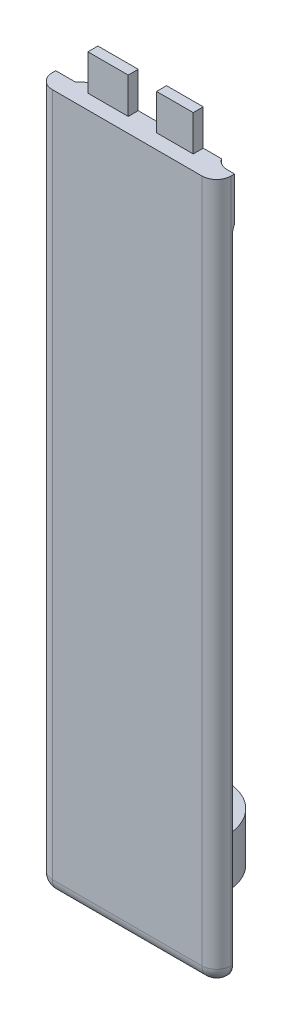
ISO-10303-21;
HEADER;
FILE_DESCRIPTION(('STEP AP214'),'2;1');
FILE_NAME('part.step','',(''),(''),'','','');
FILE_SCHEMA(('AUTOMOTIVE_DESIGN { 1 0 10303 214 1 1 1 1 }'));
ENDSEC;
DATA;
#1=APPLICATION_CONTEXT('core data for automotive mechanical design processes');
#2=APPLICATION_PROTOCOL_DEFINITION('international standard','automotive_design',2000,#1);
#3=PRODUCT_CONTEXT('',#1,'mechanical');
#4=PRODUCT('Part','Part','',(#3));
#5=PRODUCT_RELATED_PRODUCT_CATEGORY('part','',(#4));
#6=PRODUCT_DEFINITION_FORMATION('','',#4);
#7=PRODUCT_DEFINITION_CONTEXT('part definition',#1,'design');
#8=PRODUCT_DEFINITION('design','',#6,#7);
#9=PRODUCT_DEFINITION_SHAPE('','',#8);
#10=(LENGTH_UNIT() NAMED_UNIT(*) SI_UNIT(.MILLI.,.METRE.));
#11=(NAMED_UNIT(*) PLANE_ANGLE_UNIT() SI_UNIT($,.RADIAN.));
#12=(NAMED_UNIT(*) SI_UNIT($,.STERADIAN.) SOLID_ANGLE_UNIT());
#13=UNCERTAINTY_MEASURE_WITH_UNIT(LENGTH_MEASURE(1.E-05),#10,'distance_accuracy_value','');
#14=(GEOMETRIC_REPRESENTATION_CONTEXT(3) GLOBAL_UNCERTAINTY_ASSIGNED_CONTEXT((#13)) GLOBAL_UNIT_ASSIGNED_CONTEXT((#10,
#11,#12)) REPRESENTATION_CONTEXT('',''));
#15=CARTESIAN_POINT('',(0.,0.,0.));
#16=DIRECTION('',(0.,0.,1.));
#17=DIRECTION('',(1.,0.,0.));
#18=AXIS2_PLACEMENT_3D('',#15,#16,#17);
#19=CARTESIAN_POINT('',(18.3794784,75.486715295,5.07999999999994));
#20=DIRECTION('',(-1.,0.,0.));
#21=DIRECTION('',(0.,-1.,0.));
#22=AXIS2_PLACEMENT_3D('',#19,#20,#21);
#23=PLANE('',#22);
#24=DIRECTION('',(0.,1.,0.));
#25=VECTOR('',#24,1.);
#26=CARTESIAN_POINT('',(18.3794784,-75.486715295,2.07999999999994));
#27=LINE('',#26,#25);
#28=CARTESIAN_POINT('',(18.3794784,68.1207152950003,2.07999999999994));
#29=VERTEX_POINT('',#28);
#30=CARTESIAN_POINT('',(18.3794784,-72.486715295,2.07999999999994));
#31=VERTEX_POINT('',#30);
#32=EDGE_CURVE('E337',#29,#31,#27,.F.);
#33=ORIENTED_EDGE('',*,*,#32,.T.);
#34=DIRECTION('',(0.,0.,-1.));
#35=VECTOR('',#34,1.);
#36=CARTESIAN_POINT('',(18.3794784,-72.486715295,5.07999999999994));
#37=LINE('',#36,#35);
#38=CARTESIAN_POINT('',(18.3794784,-72.486715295,1.78588006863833));
#39=VERTEX_POINT('',#38);
#40=EDGE_CURVE('E356',#31,#39,#37,.T.);
#41=ORIENTED_EDGE('',*,*,#40,.T.);
#42=DIRECTION('',(0.,-1.,0.));
#43=VECTOR('',#42,1.);
#44=CARTESIAN_POINT('',(18.3794784,60.403284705,1.78588006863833));
#45=LINE('',#44,#43);
#46=CARTESIAN_POINT('',(18.3794784,57.6599449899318,1.78588006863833));
#47=VERTEX_POINT('',#46);
#48=EDGE_CURVE('E316',#47,#39,#45,.T.);
#49=ORIENTED_EDGE('',*,*,#48,.F.);
#50=CARTESIAN_POINT('',(18.3794784,57.6599449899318,-1.21411993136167));
#51=DIRECTION('',(-1.,0.,0.));
#52=DIRECTION('',(0.,-1.,0.));
#53=AXIS2_PLACEMENT_3D('',#50,#51,#52);
#54=CIRCLE('',#53,3.);
#55=CARTESIAN_POINT('',(18.3794784,59.1939911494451,1.364));
#56=VERTEX_POINT('',#55);
#57=EDGE_CURVE('E423',#47,#56,#54,.T.);
#58=ORIENTED_EDGE('',*,*,#57,.T.);
#59=DIRECTION('',(0.,-1.,0.));
#60=VECTOR('',#59,1.);
#61=CARTESIAN_POINT('',(18.3794784,68.1207152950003,1.364));
#62=LINE('',#61,#60);
#63=CARTESIAN_POINT('',(18.3794784,68.1207152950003,1.364));
#64=VERTEX_POINT('',#63);
#65=EDGE_CURVE('E238',#64,#56,#62,.T.);
#66=ORIENTED_EDGE('',*,*,#65,.F.);
#67=DIRECTION('',(0.,0.,-1.));
#68=VECTOR('',#67,1.);
#69=CARTESIAN_POINT('',(18.3794784,68.1207152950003,5.07999999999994));
#70=LINE('',#69,#68);
#71=EDGE_CURVE('E298',#29,#64,#70,.T.);
#72=ORIENTED_EDGE('',*,*,#71,.F.);
#73=EDGE_LOOP('',(#33,#41,#49,#58,#66,#72));
#74=FACE_BOUND('',#73,.T.);
#75=ADVANCED_FACE('F34',(#74),#23,.F.);
#76=CARTESIAN_POINT('',(-18.3794784,75.486715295,5.07999999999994));
#77=DIRECTION('',(0.,-1.,0.));
#78=DIRECTION('',(0.,0.,-1.));
#79=AXIS2_PLACEMENT_3D('',#76,#77,#78);
#80=PLANE('',#79);
#81=DIRECTION('',(0.,0.,-1.));
#82=VECTOR('',#81,1.);
#83=CARTESIAN_POINT('',(-2.79308503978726,75.486715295,0.));
#84=LINE('',#83,#82);
#85=CARTESIAN_POINT('',(-2.79308503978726,75.486715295,2.05831786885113));
#86=VERTEX_POINT('',#85);
#87=CARTESIAN_POINT('',(-2.79308503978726,75.486715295,0.));
#88=VERTEX_POINT('',#87);
#89=EDGE_CURVE('E249',#86,#88,#84,.T.);
#90=ORIENTED_EDGE('',*,*,#89,.T.);
#91=DIRECTION('',(-1.,0.,0.));
#92=VECTOR('',#91,1.);
#93=CARTESIAN_POINT('',(-18.3794784,75.486715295,0.));
#94=LINE('',#93,#92);
#95=CARTESIAN_POINT('',(-11.0789714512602,75.486715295,0.));
#96=VERTEX_POINT('',#95);
#97=EDGE_CURVE('E321',#88,#96,#94,.T.);
#98=ORIENTED_EDGE('',*,*,#97,.T.);
#99=DIRECTION('',(0.,0.,-1.));
#100=VECTOR('',#99,1.);
#101=CARTESIAN_POINT('',(-11.0789714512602,75.486715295,0.));
#102=LINE('',#101,#100);
#103=CARTESIAN_POINT('',(-11.0789714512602,75.486715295,2.05831786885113));
#104=VERTEX_POINT('',#103);
#105=EDGE_CURVE('E267',#104,#96,#102,.T.);
#106=ORIENTED_EDGE('',*,*,#105,.F.);
#107=DIRECTION('',(-1.,0.,0.));
#108=VECTOR('',#107,1.);
#109=CARTESIAN_POINT('',(18.3794784,75.486715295,2.05831786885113));
#110=LINE('',#109,#108);
#111=EDGE_CURVE('E296',#86,#104,#110,.T.);
#112=ORIENTED_EDGE('',*,*,#111,.F.);
#113=EDGE_LOOP('',(#90,#98,#106,#112));
#114=FACE_BOUND('',#113,.T.);
#115=ADVANCED_FACE('F457',(#114),#80,.F.);
#116=CARTESIAN_POINT('',(0.,0.,0.));
#117=DIRECTION('',(0.,0.,1.));
#118=DIRECTION('',(1.,0.,0.));
#119=AXIS2_PLACEMENT_3D('',#116,#117,#118);
#120=PLANE('',#119);
#121=DIRECTION('',(1.,0.,0.));
#122=VECTOR('',#121,1.);
#123=CARTESIAN_POINT('',(-18.3794784,60.403284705,0.));
#124=LINE('',#123,#122);
#125=CARTESIAN_POINT('',(-11.8087661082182,60.403284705,0.));
#126=VERTEX_POINT('',#125);
#127=CARTESIAN_POINT('',(14.3383237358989,60.403284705,0.));
#128=VERTEX_POINT('',#127);
#129=EDGE_CURVE('E314',#126,#128,#124,.T.);
#130=ORIENTED_EDGE('',*,*,#129,.F.);
#131=DIRECTION('',(0.,-1.,0.));
#132=VECTOR('',#131,1.);
#133=CARTESIAN_POINT('',(-11.8087661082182,0.,0.));
#134=LINE('',#133,#132);
#135=CARTESIAN_POINT('',(-11.8087661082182,68.1207152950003,0.));
#136=VERTEX_POINT('',#135);
#137=EDGE_CURVE('E43',#126,#136,#134,.F.);
#138=ORIENTED_EDGE('',*,*,#137,.T.);
#139=DIRECTION('',(-1.,0.,0.));
#140=VECTOR('',#139,1.);
#141=CARTESIAN_POINT('',(-18.3794784,68.1207152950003,0.));
#142=LINE('',#141,#140);
#143=CARTESIAN_POINT('',(-11.0789714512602,68.1207152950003,0.));
#144=VERTEX_POINT('',#143);
#145=EDGE_CURVE('E225',#144,#136,#142,.T.);
#146=ORIENTED_EDGE('',*,*,#145,.F.);
#147=DIRECTION('',(0.,1.,0.));
#148=VECTOR('',#147,1.);
#149=CARTESIAN_POINT('',(-11.0789714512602,68.1207152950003,0.));
#150=LINE('',#149,#148);
#151=EDGE_CURVE('E281',#144,#96,#150,.T.);
#152=ORIENTED_EDGE('',*,*,#151,.T.);
#153=ORIENTED_EDGE('',*,*,#97,.F.);
#154=DIRECTION('',(0.,1.,0.));
#155=VECTOR('',#154,1.);
#156=CARTESIAN_POINT('',(-2.79308503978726,68.1207152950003,0.));
#157=LINE('',#156,#155);
#158=CARTESIAN_POINT('',(-2.79308503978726,68.1207152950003,0.));
#159=VERTEX_POINT('',#158);
#160=EDGE_CURVE('E265',#159,#88,#157,.T.);
#161=ORIENTED_EDGE('',*,*,#160,.F.);
#162=DIRECTION('',(-1.,0.,0.));
#163=VECTOR('',#162,1.);
#164=CARTESIAN_POINT('',(0.,68.1207152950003,0.));
#165=LINE('',#164,#163);
#166=CARTESIAN_POINT('',(3.02839066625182,68.1207152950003,0.));
#167=VERTEX_POINT('',#166);
#168=EDGE_CURVE('E258',#167,#159,#165,.T.);
#169=ORIENTED_EDGE('',*,*,#168,.F.);
#170=DIRECTION('',(0.,1.,0.));
#171=VECTOR('',#170,1.);
#172=CARTESIAN_POINT('',(3.02839066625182,68.1207152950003,0.));
#173=LINE('',#172,#171);
#174=CARTESIAN_POINT('',(3.02839066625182,75.486715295,0.));
#175=VERTEX_POINT('',#174);
#176=EDGE_CURVE('E268',#167,#175,#173,.T.);
#177=ORIENTED_EDGE('',*,*,#176,.T.);
#178=CARTESIAN_POINT('',(10.5705623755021,75.486715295,0.));
#179=VERTEX_POINT('',#178);
#180=EDGE_CURVE('E323',#179,#175,#94,.T.);
#181=ORIENTED_EDGE('',*,*,#180,.F.);
#182=DIRECTION('',(0.,1.,0.));
#183=VECTOR('',#182,1.);
#184=CARTESIAN_POINT('',(10.5705623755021,68.1207152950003,0.));
#185=LINE('',#184,#183);
#186=CARTESIAN_POINT('',(10.5705623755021,68.1207152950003,0.));
#187=VERTEX_POINT('',#186);
#188=EDGE_CURVE('E291',#187,#179,#185,.T.);
#189=ORIENTED_EDGE('',*,*,#188,.F.);
#190=DIRECTION('',(-1.,0.,0.));
#191=VECTOR('',#190,1.);
#192=CARTESIAN_POINT('',(18.3794784,68.1207152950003,0.));
#193=LINE('',#192,#191);
#194=CARTESIAN_POINT('',(14.3383237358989,68.1207152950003,0.));
#195=VERTEX_POINT('',#194);
#196=EDGE_CURVE('E287',#195,#187,#193,.T.);
#197=ORIENTED_EDGE('',*,*,#196,.F.);
#198=DIRECTION('',(0.,1.,0.));
#199=VECTOR('',#198,1.);
#200=CARTESIAN_POINT('',(14.3383237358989,68.1207152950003,0.));
#201=LINE('',#200,#199);
#202=EDGE_CURVE('E235',#128,#195,#201,.T.);
#203=ORIENTED_EDGE('',*,*,#202,.F.);
#204=EDGE_LOOP('',(#130,#138,#146,#152,#153,#161,#169,#177,#181,#189,#197,#203));
#205=FACE_BOUND('',#204,.T.);
#206=ADVANCED_FACE('F463',(#205),#120,.F.);
#207=CARTESIAN_POINT('',(18.3794784,68.1207152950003,2.05831786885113));
#208=DIRECTION('',(0.,0.,-1.));
#209=DIRECTION('',(-1.,0.,0.));
#210=AXIS2_PLACEMENT_3D('',#207,#208,#209);
#211=PLANE('',#210);
#212=DIRECTION('',(0.,1.,0.));
#213=VECTOR('',#212,1.);
#214=CARTESIAN_POINT('',(-2.79308503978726,68.1207152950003,2.05831786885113));
#215=LINE('',#214,#213);
#216=CARTESIAN_POINT('',(-2.79308503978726,68.1207152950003,2.05831786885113));
#217=VERTEX_POINT('',#216);
#218=EDGE_CURVE('E261',#217,#86,#215,.T.);
#219=ORIENTED_EDGE('',*,*,#218,.T.);
#220=ORIENTED_EDGE('',*,*,#111,.T.);
#221=DIRECTION('',(0.,1.,0.));
#222=VECTOR('',#221,1.);
#223=CARTESIAN_POINT('',(-11.0789714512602,68.1207152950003,2.05831786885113));
#224=LINE('',#223,#222);
#225=CARTESIAN_POINT('',(-11.0789714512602,68.1207152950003,2.05831786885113));
#226=VERTEX_POINT('',#225);
#227=EDGE_CURVE('E278',#226,#104,#224,.T.);
#228=ORIENTED_EDGE('',*,*,#227,.F.);
#229=DIRECTION('',(-1.,0.,0.));
#230=VECTOR('',#229,1.);
#231=CARTESIAN_POINT('',(18.3794784,68.1207152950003,2.05831786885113));
#232=LINE('',#231,#230);
#233=EDGE_CURVE('E301',#217,#226,#232,.T.);
#234=ORIENTED_EDGE('',*,*,#233,.F.);
#235=EDGE_LOOP('',(#219,#220,#228,#234));
#236=FACE_BOUND('',#235,.T.);
#237=ADVANCED_FACE('F567',(#236),#211,.F.);
#238=CARTESIAN_POINT('',(-18.3794784,75.486715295,5.07999999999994));
#239=DIRECTION('',(1.,0.,0.));
#240=DIRECTION('',(0.,1.,0.));
#241=AXIS2_PLACEMENT_3D('',#238,#239,#240);
#242=PLANE('',#241);
#243=DIRECTION('',(0.,1.,0.));
#244=VECTOR('',#243,1.);
#245=CARTESIAN_POINT('',(-18.3794784,68.1207152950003,1.364));
#246=LINE('',#245,#244);
#247=CARTESIAN_POINT('',(-18.3794784,59.1939911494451,1.364));
#248=VERTEX_POINT('',#247);
#249=CARTESIAN_POINT('',(-18.3794784,68.1207152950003,1.364));
#250=VERTEX_POINT('',#249);
#251=EDGE_CURVE('E233',#248,#250,#246,.T.);
#252=ORIENTED_EDGE('',*,*,#251,.F.);
#253=CARTESIAN_POINT('',(-18.3794784,57.6599449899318,-1.21411993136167));
#254=DIRECTION('',(1.,0.,0.));
#255=DIRECTION('',(0.,1.,0.));
#256=AXIS2_PLACEMENT_3D('',#253,#254,#255);
#257=CIRCLE('',#256,3.);
#258=CARTESIAN_POINT('',(-18.3794784,57.6599449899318,1.78588006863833));
#259=VERTEX_POINT('',#258);
#260=EDGE_CURVE('E421',#248,#259,#257,.T.);
#261=ORIENTED_EDGE('',*,*,#260,.T.);
#262=DIRECTION('',(0.,-1.,0.));
#263=VECTOR('',#262,1.);
#264=CARTESIAN_POINT('',(-18.3794784,60.403284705,1.78588006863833));
#265=LINE('',#264,#263);
#266=CARTESIAN_POINT('',(-18.3794784,-72.486715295,1.78588006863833));
#267=VERTEX_POINT('',#266);
#268=EDGE_CURVE('E319',#259,#267,#265,.T.);
#269=ORIENTED_EDGE('',*,*,#268,.T.);
#270=DIRECTION('',(0.,0.,-1.));
#271=VECTOR('',#270,1.);
#272=CARTESIAN_POINT('',(-18.3794784,-72.486715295,5.07999999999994));
#273=LINE('',#272,#271);
#274=CARTESIAN_POINT('',(-18.3794784,-72.486715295,2.07999999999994));
#275=VERTEX_POINT('',#274);
#276=EDGE_CURVE('E352',#267,#275,#273,.F.);
#277=ORIENTED_EDGE('',*,*,#276,.T.);
#278=DIRECTION('',(0.,-1.,0.));
#279=VECTOR('',#278,1.);
#280=CARTESIAN_POINT('',(-18.3794784,68.1207152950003,2.07999999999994));
#281=LINE('',#280,#279);
#282=CARTESIAN_POINT('',(-18.3794784,68.1207152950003,2.07999999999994));
#283=VERTEX_POINT('',#282);
#284=EDGE_CURVE('E329',#275,#283,#281,.F.);
#285=ORIENTED_EDGE('',*,*,#284,.T.);
#286=DIRECTION('',(0.,0.,1.));
#287=VECTOR('',#286,1.);
#288=CARTESIAN_POINT('',(-18.3794784,68.1207152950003,5.07999999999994));
#289=LINE('',#288,#287);
#290=EDGE_CURVE('E306',#250,#283,#289,.T.);
#291=ORIENTED_EDGE('',*,*,#290,.F.);
#292=EDGE_LOOP('',(#252,#261,#269,#277,#285,#291));
#293=FACE_BOUND('',#292,.T.);
#294=ADVANCED_FACE('F574',(#293),#242,.F.);
#295=CARTESIAN_POINT('',(0.,0.,5.07999999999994));
#296=DIRECTION('',(0.,0.,1.));
#297=DIRECTION('',(1.,0.,0.));
#298=AXIS2_PLACEMENT_3D('',#295,#296,#297);
#299=PLANE('',#298);
#300=DIRECTION('',(0.,-1.,0.));
#301=VECTOR('',#300,1.);
#302=CARTESIAN_POINT('',(-15.3794784,-75.486715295,5.07999999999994));
#303=LINE('',#302,#301);
#304=CARTESIAN_POINT('',(-15.3794784,68.1207152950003,5.07999999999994));
#305=VERTEX_POINT('',#304);
#306=CARTESIAN_POINT('',(-15.3794784,-72.486715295,5.07999999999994));
#307=VERTEX_POINT('',#306);
#308=EDGE_CURVE('E326',#305,#307,#303,.T.);
#309=ORIENTED_EDGE('',*,*,#308,.T.);
#310=DIRECTION('',(1.,0.,0.));
#311=VECTOR('',#310,1.);
#312=CARTESIAN_POINT('',(15.3794784,-72.486715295,5.07999999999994));
#313=LINE('',#312,#311);
#314=CARTESIAN_POINT('',(15.3794784,-72.486715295,5.07999999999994));
#315=VERTEX_POINT('',#314);
#316=EDGE_CURVE('E361',#307,#315,#313,.T.);
#317=ORIENTED_EDGE('',*,*,#316,.T.);
#318=DIRECTION('',(0.,1.,0.));
#319=VECTOR('',#318,1.);
#320=CARTESIAN_POINT('',(15.3794784,68.1207152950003,5.07999999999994));
#321=LINE('',#320,#319);
#322=CARTESIAN_POINT('',(15.3794784,68.1207152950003,5.07999999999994));
#323=VERTEX_POINT('',#322);
#324=EDGE_CURVE('E333',#315,#323,#321,.T.);
#325=ORIENTED_EDGE('',*,*,#324,.T.);
#326=DIRECTION('',(1.,0.,0.));
#327=VECTOR('',#326,1.);
#328=CARTESIAN_POINT('',(18.3794784,68.1207152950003,5.07999999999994));
#329=LINE('',#328,#327);
#330=EDGE_CURVE('E308',#305,#323,#329,.T.);
#331=ORIENTED_EDGE('',*,*,#330,.F.);
#332=EDGE_LOOP('',(#309,#317,#325,#331));
#333=FACE_BOUND('',#332,.T.);
#334=ADVANCED_FACE('F571',(#333),#299,.T.);
#335=ORIENTED_EDGE('',*,*,#180,.T.);
#336=DIRECTION('',(0.,0.,-1.));
#337=VECTOR('',#336,1.);
#338=CARTESIAN_POINT('',(3.02839066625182,75.486715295,0.));
#339=LINE('',#338,#337);
#340=CARTESIAN_POINT('',(3.02839066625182,75.486715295,2.05831786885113));
#341=VERTEX_POINT('',#340);
#342=EDGE_CURVE('E255',#341,#175,#339,.T.);
#343=ORIENTED_EDGE('',*,*,#342,.F.);
#344=CARTESIAN_POINT('',(10.5705623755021,75.486715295,2.05831786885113));
#345=VERTEX_POINT('',#344);
#346=EDGE_CURVE('E302',#345,#341,#110,.T.);
#347=ORIENTED_EDGE('',*,*,#346,.F.);
#348=DIRECTION('',(0.,0.,1.));
#349=VECTOR('',#348,1.);
#350=CARTESIAN_POINT('',(10.5705623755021,75.486715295,2.05831786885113));
#351=LINE('',#350,#349);
#352=EDGE_CURVE('E284',#179,#345,#351,.T.);
#353=ORIENTED_EDGE('',*,*,#352,.F.);
#354=EDGE_LOOP('',(#335,#343,#347,#353));
#355=FACE_BOUND('',#354,.T.);
#356=ADVANCED_FACE('F466',(#355),#80,.F.);
#357=CARTESIAN_POINT('',(-18.3794784,-75.486715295,5.07999999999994));
#358=DIRECTION('',(0.,1.,0.));
#359=DIRECTION('',(0.,0.,1.));
#360=AXIS2_PLACEMENT_3D('',#357,#358,#359);
#361=PLANE('',#360);
#362=DIRECTION('',(1.,0.,0.));
#363=VECTOR('',#362,1.);
#364=CARTESIAN_POINT('',(-15.3794784,-75.486715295,2.07999999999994));
#365=LINE('',#364,#363);
#366=CARTESIAN_POINT('',(15.3794784,-75.486715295,2.07999999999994));
#367=VERTEX_POINT('',#366);
#368=CARTESIAN_POINT('',(-15.3794784,-75.486715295,2.07999999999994));
#369=VERTEX_POINT('',#368);
#370=EDGE_CURVE('E340',#367,#369,#365,.F.);
#371=ORIENTED_EDGE('',*,*,#370,.T.);
#372=DIRECTION('',(0.,0.,-1.));
#373=VECTOR('',#372,1.);
#374=CARTESIAN_POINT('',(-15.3794784,-75.486715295,5.07999999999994));
#375=LINE('',#374,#373);
#376=CARTESIAN_POINT('',(-15.3794784,-75.486715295,1.78588006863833));
#377=VERTEX_POINT('',#376);
#378=EDGE_CURVE('E344',#369,#377,#375,.T.);
#379=ORIENTED_EDGE('',*,*,#378,.T.);
#380=DIRECTION('',(-1.,0.,0.));
#381=VECTOR('',#380,1.);
#382=CARTESIAN_POINT('',(-18.3794784,-75.486715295,1.78588006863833));
#383=LINE('',#382,#381);
#384=CARTESIAN_POINT('',(15.3794784,-75.486715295,1.78588006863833));
#385=VERTEX_POINT('',#384);
#386=EDGE_CURVE('E311',#385,#377,#383,.T.);
#387=ORIENTED_EDGE('',*,*,#386,.F.);
#388=DIRECTION('',(0.,0.,-1.));
#389=VECTOR('',#388,1.);
#390=CARTESIAN_POINT('',(15.3794784,-75.486715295,5.07999999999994));
#391=LINE('',#390,#389);
#392=EDGE_CURVE('E342',#385,#367,#391,.F.);
#393=ORIENTED_EDGE('',*,*,#392,.T.);
#394=EDGE_LOOP('',(#371,#379,#387,#393));
#395=FACE_BOUND('',#394,.T.);
#396=ADVANCED_FACE('F570',(#395),#361,.F.);
#397=CARTESIAN_POINT('',(-18.3794784,60.403284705,1.78588006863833));
#398=DIRECTION('',(0.,0.,1.));
#399=DIRECTION('',(1.,0.,0.));
#400=AXIS2_PLACEMENT_3D('',#397,#398,#399);
#401=PLANE('',#400);
#402=DIRECTION('',(1.,0.,0.));
#403=VECTOR('',#402,1.);
#404=CARTESIAN_POINT('',(-18.3794784,-70.836715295,1.78588006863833));
#405=LINE('',#404,#403);
#406=CARTESIAN_POINT('',(-12.0851937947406,-70.836715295,1.78588006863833));
#407=VERTEX_POINT('',#406);
#408=CARTESIAN_POINT('',(11.4851937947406,-70.836715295,1.78588006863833));
#409=VERTEX_POINT('',#408);
#410=EDGE_CURVE('E363',#407,#409,#405,.T.);
#411=ORIENTED_EDGE('',*,*,#410,.T.);
#412=DIRECTION('',(0.,-1.,0.));
#413=VECTOR('',#412,1.);
#414=CARTESIAN_POINT('',(11.4851937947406,-54.836715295,1.78588006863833));
#415=LINE('',#414,#413);
#416=CARTESIAN_POINT('',(11.4851937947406,-54.836715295,1.78588006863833));
#417=VERTEX_POINT('',#416);
#418=EDGE_CURVE('E392',#409,#417,#415,.F.);
#419=ORIENTED_EDGE('',*,*,#418,.T.);
#420=DIRECTION('',(1.,0.,0.));
#421=VECTOR('',#420,1.);
#422=CARTESIAN_POINT('',(-6.17499041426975,-54.836715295,1.78588006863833));
#423=LINE('',#422,#421);
#424=CARTESIAN_POINT('',(-12.0851937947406,-54.836715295,1.78588006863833));
#425=VERTEX_POINT('',#424);
#426=EDGE_CURVE('E381',#417,#425,#423,.F.);
#427=ORIENTED_EDGE('',*,*,#426,.T.);
#428=DIRECTION('',(0.,-1.,0.));
#429=VECTOR('',#428,1.);
#430=CARTESIAN_POINT('',(-12.0851937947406,-70.836715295,1.78588006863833));
#431=LINE('',#430,#429);
#432=EDGE_CURVE('E389',#425,#407,#431,.T.);
#433=ORIENTED_EDGE('',*,*,#432,.T.);
#434=EDGE_LOOP('',(#411,#419,#427,#433));
#435=FACE_BOUND('',#434,.T.);
#436=ORIENTED_EDGE('',*,*,#268,.F.);
#437=DIRECTION('',(1.,0.,0.));
#438=VECTOR('',#437,1.);
#439=CARTESIAN_POINT('',(-18.3794784,57.6599449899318,1.78588006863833));
#440=LINE('',#439,#438);
#441=EDGE_CURVE('E417',#259,#47,#440,.T.);
#442=ORIENTED_EDGE('',*,*,#441,.T.);
#443=ORIENTED_EDGE('',*,*,#48,.T.);
#444=CARTESIAN_POINT('',(15.3794784,-72.486715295,1.78588006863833));
#445=DIRECTION('',(0.,0.,1.));
#446=DIRECTION('',(1.,0.,0.));
#447=AXIS2_PLACEMENT_3D('',#444,#445,#446);
#448=CIRCLE('',#447,3.);
#449=EDGE_CURVE('E347',#39,#385,#448,.F.);
#450=ORIENTED_EDGE('',*,*,#449,.T.);
#451=ORIENTED_EDGE('',*,*,#386,.T.);
#452=CARTESIAN_POINT('',(-15.3794784,-72.486715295,1.78588006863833));
#453=DIRECTION('',(0.,0.,1.));
#454=DIRECTION('',(1.,0.,0.));
#455=AXIS2_PLACEMENT_3D('',#452,#453,#454);
#456=CIRCLE('',#455,3.);
#457=EDGE_CURVE('E349',#377,#267,#456,.F.);
#458=ORIENTED_EDGE('',*,*,#457,.T.);
#459=EDGE_LOOP('',(#436,#442,#443,#450,#451,#458));
#460=FACE_BOUND('',#459,.T.);
#461=ADVANCED_FACE('F520',(#435,#460),#401,.F.);
#462=ORIENTED_EDGE('',*,*,#346,.T.);
#463=DIRECTION('',(0.,1.,0.));
#464=VECTOR('',#463,1.);
#465=CARTESIAN_POINT('',(3.02839066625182,68.1207152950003,2.05831786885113));
#466=LINE('',#465,#464);
#467=CARTESIAN_POINT('',(3.02839066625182,68.1207152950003,2.05831786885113));
#468=VERTEX_POINT('',#467);
#469=EDGE_CURVE('E271',#468,#341,#466,.T.);
#470=ORIENTED_EDGE('',*,*,#469,.F.);
#471=CARTESIAN_POINT('',(10.5705623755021,68.1207152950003,2.05831786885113));
#472=VERTEX_POINT('',#471);
#473=EDGE_CURVE('E303',#472,#468,#232,.T.);
#474=ORIENTED_EDGE('',*,*,#473,.F.);
#475=DIRECTION('',(0.,1.,0.));
#476=VECTOR('',#475,1.);
#477=CARTESIAN_POINT('',(10.5705623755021,68.1207152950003,2.05831786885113));
#478=LINE('',#477,#476);
#479=EDGE_CURVE('E293',#472,#345,#478,.T.);
#480=ORIENTED_EDGE('',*,*,#479,.T.);
#481=EDGE_LOOP('',(#462,#470,#474,#480));
#482=FACE_BOUND('',#481,.T.);
#483=ADVANCED_FACE('F563',(#482),#211,.F.);
#484=CARTESIAN_POINT('',(0.,68.1207152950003,0.));
#485=DIRECTION('',(0.,1.,0.));
#486=DIRECTION('',(0.,0.,1.));
#487=AXIS2_PLACEMENT_3D('',#484,#485,#486);
#488=PLANE('',#487);
#489=ORIENTED_EDGE('',*,*,#145,.T.);
#490=CARTESIAN_POINT('',(-11.8087661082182,68.1207152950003,3.));
#491=DIRECTION('',(0.,1.,0.));
#492=DIRECTION('',(0.,0.,1.));
#493=AXIS2_PLACEMENT_3D('',#490,#491,#492);
#494=CIRCLE('',#493,3.);
#495=CARTESIAN_POINT('',(-14.3234239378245,68.1207152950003,1.364));
#496=VERTEX_POINT('',#495);
#497=EDGE_CURVE('E11',#136,#496,#494,.T.);
#498=ORIENTED_EDGE('',*,*,#497,.T.);
#499=DIRECTION('',(1.,0.,0.));
#500=VECTOR('',#499,1.);
#501=CARTESIAN_POINT('',(-18.3794784,68.1207152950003,1.364));
#502=LINE('',#501,#500);
#503=EDGE_CURVE('E222',#250,#496,#502,.T.);
#504=ORIENTED_EDGE('',*,*,#503,.F.);
#505=ORIENTED_EDGE('',*,*,#290,.T.);
#506=CARTESIAN_POINT('',(-15.3794784,68.1207152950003,2.07999999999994));
#507=DIRECTION('',(0.,1.,0.));
#508=DIRECTION('',(0.,0.,1.));
#509=AXIS2_PLACEMENT_3D('',#506,#507,#508);
#510=CIRCLE('',#509,3.);
#511=EDGE_CURVE('E331',#283,#305,#510,.T.);
#512=ORIENTED_EDGE('',*,*,#511,.T.);
#513=ORIENTED_EDGE('',*,*,#330,.T.);
#514=CARTESIAN_POINT('',(15.3794784,68.1207152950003,2.07999999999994));
#515=DIRECTION('',(0.,1.,0.));
#516=DIRECTION('',(0.,0.,1.));
#517=AXIS2_PLACEMENT_3D('',#514,#515,#516);
#518=CIRCLE('',#517,3.);
#519=EDGE_CURVE('E335',#323,#29,#518,.T.);
#520=ORIENTED_EDGE('',*,*,#519,.T.);
#521=ORIENTED_EDGE('',*,*,#71,.T.);
#522=DIRECTION('',(1.,0.,0.));
#523=VECTOR('',#522,1.);
#524=CARTESIAN_POINT('',(18.3794784,68.1207152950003,1.364));
#525=LINE('',#524,#523);
#526=CARTESIAN_POINT('',(16.8529815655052,68.1207152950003,1.364));
#527=VERTEX_POINT('',#526);
#528=EDGE_CURVE('E243',#527,#64,#525,.T.);
#529=ORIENTED_EDGE('',*,*,#528,.F.);
#530=CARTESIAN_POINT('',(16.8529815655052,68.1207152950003,-1.636));
#531=DIRECTION('',(0.,1.,0.));
#532=DIRECTION('',(0.,0.,1.));
#533=AXIS2_PLACEMENT_3D('',#530,#531,#532);
#534=CIRCLE('',#533,3.);
#535=EDGE_CURVE('E432',#527,#195,#534,.F.);
#536=ORIENTED_EDGE('',*,*,#535,.T.);
#537=ORIENTED_EDGE('',*,*,#196,.T.);
#538=DIRECTION('',(0.,0.,1.));
#539=VECTOR('',#538,1.);
#540=CARTESIAN_POINT('',(10.5705623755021,68.1207152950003,2.05831786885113));
#541=LINE('',#540,#539);
#542=EDGE_CURVE('E289',#187,#472,#541,.T.);
#543=ORIENTED_EDGE('',*,*,#542,.T.);
#544=ORIENTED_EDGE('',*,*,#473,.T.);
#545=DIRECTION('',(0.,0.,-1.));
#546=VECTOR('',#545,1.);
#547=CARTESIAN_POINT('',(3.02839066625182,68.1207152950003,0.));
#548=LINE('',#547,#546);
#549=EDGE_CURVE('E254',#468,#167,#548,.T.);
#550=ORIENTED_EDGE('',*,*,#549,.T.);
#551=ORIENTED_EDGE('',*,*,#168,.T.);
#552=DIRECTION('',(0.,0.,-1.));
#553=VECTOR('',#552,1.);
#554=CARTESIAN_POINT('',(-2.79308503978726,68.1207152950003,0.));
#555=LINE('',#554,#553);
#556=EDGE_CURVE('E252',#217,#159,#555,.T.);
#557=ORIENTED_EDGE('',*,*,#556,.F.);
#558=ORIENTED_EDGE('',*,*,#233,.T.);
#559=DIRECTION('',(0.,0.,-1.));
#560=VECTOR('',#559,1.);
#561=CARTESIAN_POINT('',(-11.0789714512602,68.1207152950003,0.));
#562=LINE('',#561,#560);
#563=EDGE_CURVE('E275',#226,#144,#562,.T.);
#564=ORIENTED_EDGE('',*,*,#563,.T.);
#565=EDGE_LOOP('',(#489,#498,#504,#505,#512,#513,#520,#521,#529,#536,#537,#543,#544,#550,#551,
#557,#558,#564));
#566=FACE_BOUND('',#565,.T.);
#567=ADVANCED_FACE('F220',(#566),#488,.T.);
#568=CARTESIAN_POINT('',(10.5705623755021,68.1207152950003,2.05831786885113));
#569=DIRECTION('',(-1.,0.,0.));
#570=DIRECTION('',(0.,0.,1.));
#571=AXIS2_PLACEMENT_3D('',#568,#569,#570);
#572=PLANE('',#571);
#573=ORIENTED_EDGE('',*,*,#352,.T.);
#574=ORIENTED_EDGE('',*,*,#479,.F.);
#575=ORIENTED_EDGE('',*,*,#542,.F.);
#576=ORIENTED_EDGE('',*,*,#188,.T.);
#577=EDGE_LOOP('',(#573,#574,#575,#576));
#578=FACE_BOUND('',#577,.T.);
#579=ADVANCED_FACE('F556',(#578),#572,.F.);
#580=CARTESIAN_POINT('',(-11.0789714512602,68.1207152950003,0.));
#581=DIRECTION('',(1.,0.,0.));
#582=DIRECTION('',(0.,0.,-1.));
#583=AXIS2_PLACEMENT_3D('',#580,#581,#582);
#584=PLANE('',#583);
#585=ORIENTED_EDGE('',*,*,#105,.T.);
#586=ORIENTED_EDGE('',*,*,#151,.F.);
#587=ORIENTED_EDGE('',*,*,#563,.F.);
#588=ORIENTED_EDGE('',*,*,#227,.T.);
#589=EDGE_LOOP('',(#585,#586,#587,#588));
#590=FACE_BOUND('',#589,.T.);
#591=ADVANCED_FACE('F552',(#590),#584,.F.);
#592=CARTESIAN_POINT('',(-2.79308503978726,68.1207152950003,0.));
#593=DIRECTION('',(1.,0.,0.));
#594=DIRECTION('',(0.,0.,-1.));
#595=AXIS2_PLACEMENT_3D('',#592,#593,#594);
#596=PLANE('',#595);
#597=ORIENTED_EDGE('',*,*,#89,.F.);
#598=ORIENTED_EDGE('',*,*,#218,.F.);
#599=ORIENTED_EDGE('',*,*,#556,.T.);
#600=ORIENTED_EDGE('',*,*,#160,.T.);
#601=EDGE_LOOP('',(#597,#598,#599,#600));
#602=FACE_BOUND('',#601,.T.);
#603=ADVANCED_FACE('F548',(#602),#596,.T.);
#604=CARTESIAN_POINT('',(3.02839066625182,68.1207152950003,0.));
#605=DIRECTION('',(1.,0.,0.));
#606=DIRECTION('',(0.,0.,-1.));
#607=AXIS2_PLACEMENT_3D('',#604,#605,#606);
#608=PLANE('',#607);
#609=ORIENTED_EDGE('',*,*,#342,.T.);
#610=ORIENTED_EDGE('',*,*,#176,.F.);
#611=ORIENTED_EDGE('',*,*,#549,.F.);
#612=ORIENTED_EDGE('',*,*,#469,.T.);
#613=EDGE_LOOP('',(#609,#610,#611,#612));
#614=FACE_BOUND('',#613,.T.);
#615=ADVANCED_FACE('F541',(#614),#608,.F.);
#616=CARTESIAN_POINT('',(-0.3,-67.836715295,-5.92000000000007));
#617=DIRECTION('',(0.,1.,0.));
#618=DIRECTION('',(0.,0.,1.));
#619=AXIS2_PLACEMENT_3D('',#616,#617,#618);
#620=CYLINDRICAL_SURFACE('',#619,9.69);
#621=CARTESIAN_POINT('',(-0.3,-57.836715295,-5.92000000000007));
#622=DIRECTION('',(0.,-1.,0.));
#623=DIRECTION('',(0.,0.,-1.));
#624=AXIS2_PLACEMENT_3D('',#621,#622,#623);
#625=CIRCLE('',#624,9.69);
#626=CARTESIAN_POINT('',(-9.29909597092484,-57.836715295,-2.32662112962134));
#627=VERTEX_POINT('',#626);
#628=CARTESIAN_POINT('',(8.69909597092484,-57.836715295,-2.32662112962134));
#629=VERTEX_POINT('',#628);
#630=EDGE_CURVE('E244',#627,#629,#625,.T.);
#631=ORIENTED_EDGE('',*,*,#630,.T.);
#632=DIRECTION('',(0.,1.,0.));
#633=VECTOR('',#632,1.);
#634=CARTESIAN_POINT('',(8.69909597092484,-67.836715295,-2.32662112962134));
#635=LINE('',#634,#633);
#636=CARTESIAN_POINT('',(8.69909597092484,-67.836715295,-2.32662112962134));
#637=VERTEX_POINT('',#636);
#638=EDGE_CURVE('E386',#629,#637,#635,.F.);
#639=ORIENTED_EDGE('',*,*,#638,.T.);
#640=CARTESIAN_POINT('',(-0.3,-67.836715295,-5.92000000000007));
#641=DIRECTION('',(0.,-1.,0.));
#642=DIRECTION('',(0.,0.,-1.));
#643=AXIS2_PLACEMENT_3D('',#640,#641,#642);
#644=CIRCLE('',#643,9.69);
#645=CARTESIAN_POINT('',(-9.29909597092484,-67.836715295,-2.32662112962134));
#646=VERTEX_POINT('',#645);
#647=EDGE_CURVE('E246',#646,#637,#644,.T.);
#648=ORIENTED_EDGE('',*,*,#647,.F.);
#649=DIRECTION('',(0.,1.,0.));
#650=VECTOR('',#649,1.);
#651=CARTESIAN_POINT('',(-9.29909597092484,-67.836715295,-2.32662112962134));
#652=LINE('',#651,#650);
#653=EDGE_CURVE('E383',#646,#627,#652,.T.);
#654=ORIENTED_EDGE('',*,*,#653,.T.);
#655=EDGE_LOOP('',(#631,#639,#648,#654));
#656=FACE_BOUND('',#655,.T.);
#657=ADVANCED_FACE('F527',(#656),#620,.T.);
#658=CARTESIAN_POINT('',(-0.3,-67.836715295,-5.92000000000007));
#659=DIRECTION('',(0.,-1.,0.));
#660=DIRECTION('',(0.,0.,-1.));
#661=AXIS2_PLACEMENT_3D('',#658,#659,#660);
#662=PLANE('',#661);
#663=DIRECTION('',(1.,0.,0.));
#664=VECTOR('',#663,1.);
#665=CARTESIAN_POINT('',(-0.300000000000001,-67.836715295,-1.21411993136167));
#666=LINE('',#665,#664);
#667=CARTESIAN_POINT('',(8.48519379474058,-67.836715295,-1.21411993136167));
#668=VERTEX_POINT('',#667);
#669=CARTESIAN_POINT('',(-9.08519379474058,-67.836715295,-1.21411993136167));
#670=VERTEX_POINT('',#669);
#671=EDGE_CURVE('E377',#668,#670,#666,.F.);
#672=ORIENTED_EDGE('',*,*,#671,.T.);
#673=CARTESIAN_POINT('',(-12.0851937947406,-67.836715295,-1.21411993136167));
#674=DIRECTION('',(0.,-1.,0.));
#675=DIRECTION('',(0.,0.,-1.));
#676=AXIS2_PLACEMENT_3D('',#673,#674,#675);
#677=CIRCLE('',#676,3.);
#678=EDGE_CURVE('E415',#670,#646,#677,.F.);
#679=ORIENTED_EDGE('',*,*,#678,.T.);
#680=ORIENTED_EDGE('',*,*,#647,.T.);
#681=CARTESIAN_POINT('',(11.4851937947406,-67.836715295,-1.21411993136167));
#682=DIRECTION('',(0.,-1.,0.));
#683=DIRECTION('',(0.,0.,-1.));
#684=AXIS2_PLACEMENT_3D('',#681,#682,#683);
#685=CIRCLE('',#684,3.);
#686=EDGE_CURVE('E395',#637,#668,#685,.F.);
#687=ORIENTED_EDGE('',*,*,#686,.T.);
#688=EDGE_LOOP('',(#672,#679,#680,#687));
#689=FACE_BOUND('',#688,.T.);
#690=ADVANCED_FACE('F532',(#689),#662,.T.);
#691=CARTESIAN_POINT('',(-0.3,-57.836715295,-5.92000000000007));
#692=DIRECTION('',(0.,-1.,0.));
#693=DIRECTION('',(0.,0.,-1.));
#694=AXIS2_PLACEMENT_3D('',#691,#692,#693);
#695=PLANE('',#694);
#696=ORIENTED_EDGE('',*,*,#630,.F.);
#697=CARTESIAN_POINT('',(-12.0851937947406,-57.836715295,-1.21411993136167));
#698=DIRECTION('',(0.,-1.,0.));
#699=DIRECTION('',(0.,0.,-1.));
#700=AXIS2_PLACEMENT_3D('',#697,#698,#699);
#701=CIRCLE('',#700,3.);
#702=CARTESIAN_POINT('',(-9.08519379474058,-57.836715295,-1.21411993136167));
#703=VERTEX_POINT('',#702);
#704=EDGE_CURVE('E406',#627,#703,#701,.T.);
#705=ORIENTED_EDGE('',*,*,#704,.T.);
#706=DIRECTION('',(1.,0.,0.));
#707=VECTOR('',#706,1.);
#708=CARTESIAN_POINT('',(5.57499041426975,-57.836715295,-1.21411993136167));
#709=LINE('',#708,#707);
#710=CARTESIAN_POINT('',(8.48519379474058,-57.836715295,-1.21411993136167));
#711=VERTEX_POINT('',#710);
#712=EDGE_CURVE('E379',#703,#711,#709,.T.);
#713=ORIENTED_EDGE('',*,*,#712,.T.);
#714=CARTESIAN_POINT('',(11.4851937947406,-57.836715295,-1.21411993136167));
#715=DIRECTION('',(0.,-1.,0.));
#716=DIRECTION('',(0.,0.,-1.));
#717=AXIS2_PLACEMENT_3D('',#714,#715,#716);
#718=CIRCLE('',#717,3.);
#719=EDGE_CURVE('E404',#711,#629,#718,.T.);
#720=ORIENTED_EDGE('',*,*,#719,.T.);
#721=EDGE_LOOP('',(#696,#705,#713,#720));
#722=FACE_BOUND('',#721,.T.);
#723=ADVANCED_FACE('F529',(#722),#695,.F.);
#724=CARTESIAN_POINT('',(0.,0.,1.364));
#725=DIRECTION('',(0.,0.,-1.));
#726=DIRECTION('',(-1.,0.,0.));
#727=AXIS2_PLACEMENT_3D('',#724,#725,#726);
#728=PLANE('',#727);
#729=DIRECTION('',(1.,0.,0.));
#730=VECTOR('',#729,1.);
#731=CARTESIAN_POINT('',(18.3794784,59.1939911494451,1.364));
#732=LINE('',#731,#730);
#733=CARTESIAN_POINT('',(16.8529815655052,59.1939911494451,1.364));
#734=VERTEX_POINT('',#733);
#735=EDGE_CURVE('E426',#56,#734,#732,.F.);
#736=ORIENTED_EDGE('',*,*,#735,.T.);
#737=DIRECTION('',(0.,-1.,0.));
#738=VECTOR('',#737,1.);
#739=CARTESIAN_POINT('',(16.8529815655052,68.1207152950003,1.364));
#740=LINE('',#739,#738);
#741=EDGE_CURVE('E429',#734,#527,#740,.F.);
#742=ORIENTED_EDGE('',*,*,#741,.T.);
#743=ORIENTED_EDGE('',*,*,#528,.T.);
#744=ORIENTED_EDGE('',*,*,#65,.T.);
#745=EDGE_LOOP('',(#736,#742,#743,#744));
#746=FACE_BOUND('',#745,.T.);
#747=ADVANCED_FACE('F539',(#746),#728,.T.);
#748=CARTESIAN_POINT('',(0.,0.,1.364));
#749=DIRECTION('',(0.,0.,1.));
#750=DIRECTION('',(1.,0.,0.));
#751=AXIS2_PLACEMENT_3D('',#748,#749,#750);
#752=PLANE('',#751);
#753=ORIENTED_EDGE('',*,*,#251,.T.);
#754=ORIENTED_EDGE('',*,*,#503,.T.);
#755=DIRECTION('',(0.,-1.,0.));
#756=VECTOR('',#755,1.);
#757=CARTESIAN_POINT('',(-14.3234239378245,68.1207152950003,1.364));
#758=LINE('',#757,#756);
#759=CARTESIAN_POINT('',(-14.3234239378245,59.1939911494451,1.364));
#760=VERTEX_POINT('',#759);
#761=EDGE_CURVE('E232',#496,#760,#758,.T.);
#762=ORIENTED_EDGE('',*,*,#761,.T.);
#763=DIRECTION('',(1.,0.,0.));
#764=VECTOR('',#763,1.);
#765=CARTESIAN_POINT('',(-14.3234239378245,59.1939911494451,1.364));
#766=LINE('',#765,#764);
#767=EDGE_CURVE('E419',#760,#248,#766,.F.);
#768=ORIENTED_EDGE('',*,*,#767,.T.);
#769=EDGE_LOOP('',(#753,#754,#762,#768));
#770=FACE_BOUND('',#769,.T.);
#771=ADVANCED_FACE('F230',(#770),#752,.F.);
#772=CARTESIAN_POINT('',(-15.3794784,0.,2.07999999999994));
#773=DIRECTION('',(0.,1.,0.));
#774=DIRECTION('',(-1.,0.,0.));
#775=AXIS2_PLACEMENT_3D('',#772,#773,#774);
#776=CYLINDRICAL_SURFACE('',#775,3.);
#777=ORIENTED_EDGE('',*,*,#284,.F.);
#778=CARTESIAN_POINT('',(-15.3794784,-72.486715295,2.07999999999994));
#779=DIRECTION('',(0.,1.,0.));
#780=DIRECTION('',(-1.,0.,0.));
#781=AXIS2_PLACEMENT_3D('',#778,#779,#780);
#782=CIRCLE('',#781,3.);
#783=EDGE_CURVE('E354',#275,#307,#782,.T.);
#784=ORIENTED_EDGE('',*,*,#783,.T.);
#785=ORIENTED_EDGE('',*,*,#308,.F.);
#786=ORIENTED_EDGE('',*,*,#511,.F.);
#787=EDGE_LOOP('',(#777,#784,#785,#786));
#788=FACE_BOUND('',#787,.T.);
#789=ADVANCED_FACE('F469',(#788),#776,.T.);
#790=CARTESIAN_POINT('',(15.3794784,0.,2.07999999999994));
#791=DIRECTION('',(0.,-1.,0.));
#792=DIRECTION('',(1.,0.,0.));
#793=AXIS2_PLACEMENT_3D('',#790,#791,#792);
#794=CYLINDRICAL_SURFACE('',#793,3.);
#795=ORIENTED_EDGE('',*,*,#324,.F.);
#796=CARTESIAN_POINT('',(15.3794784,-72.486715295,2.07999999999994));
#797=DIRECTION('',(0.,-1.,0.));
#798=DIRECTION('',(1.,0.,0.));
#799=AXIS2_PLACEMENT_3D('',#796,#797,#798);
#800=CIRCLE('',#799,3.);
#801=EDGE_CURVE('E359',#315,#31,#800,.F.);
#802=ORIENTED_EDGE('',*,*,#801,.T.);
#803=ORIENTED_EDGE('',*,*,#32,.F.);
#804=ORIENTED_EDGE('',*,*,#519,.F.);
#805=EDGE_LOOP('',(#795,#802,#803,#804));
#806=FACE_BOUND('',#805,.T.);
#807=ADVANCED_FACE('F472',(#806),#794,.T.);
#808=CARTESIAN_POINT('',(15.3794784,-72.486715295,5.07999999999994));
#809=DIRECTION('',(0.,0.,-1.));
#810=DIRECTION('',(-1.,0.,0.));
#811=AXIS2_PLACEMENT_3D('',#808,#809,#810);
#812=CYLINDRICAL_SURFACE('',#811,3.);
#813=ORIENTED_EDGE('',*,*,#449,.F.);
#814=ORIENTED_EDGE('',*,*,#40,.F.);
#815=CARTESIAN_POINT('',(15.3794784,-72.486715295,2.07999999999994));
#816=DIRECTION('',(0.,0.,1.));
#817=DIRECTION('',(1.,0.,0.));
#818=AXIS2_PLACEMENT_3D('',#815,#816,#817);
#819=CIRCLE('',#818,3.);
#820=EDGE_CURVE('E373',#367,#31,#819,.T.);
#821=ORIENTED_EDGE('',*,*,#820,.F.);
#822=ORIENTED_EDGE('',*,*,#392,.F.);
#823=EDGE_LOOP('',(#813,#814,#821,#822));
#824=FACE_BOUND('',#823,.T.);
#825=ADVANCED_FACE('F476',(#824),#812,.T.);
#826=CARTESIAN_POINT('',(15.3794784,-72.486715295,2.07999999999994));
#827=DIRECTION('',(0.,1.,0.));
#828=DIRECTION('',(0.,0.,1.));
#829=AXIS2_PLACEMENT_3D('',#826,#827,#828);
#830=SPHERICAL_SURFACE('',#829,3.);
#831=ORIENTED_EDGE('',*,*,#820,.T.);
#832=ORIENTED_EDGE('',*,*,#801,.F.);
#833=CARTESIAN_POINT('',(15.3794784,-72.486715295,2.07999999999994));
#834=DIRECTION('',(-1.,0.,0.));
#835=DIRECTION('',(0.,0.,1.));
#836=AXIS2_PLACEMENT_3D('',#833,#834,#835);
#837=CIRCLE('',#836,3.);
#838=EDGE_CURVE('E370',#367,#315,#837,.T.);
#839=ORIENTED_EDGE('',*,*,#838,.F.);
#840=EDGE_LOOP('',(#831,#832,#839));
#841=FACE_BOUND('',#840,.T.);
#842=ADVANCED_FACE('F490',(#841),#830,.T.);
#843=CARTESIAN_POINT('',(0.,-72.486715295,2.07999999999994));
#844=DIRECTION('',(-1.,0.,0.));
#845=DIRECTION('',(0.,0.,1.));
#846=AXIS2_PLACEMENT_3D('',#843,#844,#845);
#847=CYLINDRICAL_SURFACE('',#846,3.);
#848=ORIENTED_EDGE('',*,*,#838,.T.);
#849=ORIENTED_EDGE('',*,*,#316,.F.);
#850=CARTESIAN_POINT('',(-15.3794784,-72.486715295,2.07999999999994));
#851=DIRECTION('',(-1.,0.,0.));
#852=DIRECTION('',(0.,0.,1.));
#853=AXIS2_PLACEMENT_3D('',#850,#851,#852);
#854=CIRCLE('',#853,3.);
#855=EDGE_CURVE('E367',#369,#307,#854,.T.);
#856=ORIENTED_EDGE('',*,*,#855,.F.);
#857=ORIENTED_EDGE('',*,*,#370,.F.);
#858=EDGE_LOOP('',(#848,#849,#856,#857));
#859=FACE_BOUND('',#858,.T.);
#860=ADVANCED_FACE('F486',(#859),#847,.T.);
#861=CARTESIAN_POINT('',(-15.3794784,-72.486715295,2.07999999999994));
#862=DIRECTION('',(0.,1.,0.));
#863=DIRECTION('',(0.,0.,1.));
#864=AXIS2_PLACEMENT_3D('',#861,#862,#863);
#865=SPHERICAL_SURFACE('',#864,3.);
#866=ORIENTED_EDGE('',*,*,#855,.T.);
#867=ORIENTED_EDGE('',*,*,#783,.F.);
#868=CARTESIAN_POINT('',(-15.3794784,-72.486715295,2.07999999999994));
#869=DIRECTION('',(0.,0.,-1.));
#870=DIRECTION('',(-1.,0.,0.));
#871=AXIS2_PLACEMENT_3D('',#868,#869,#870);
#872=CIRCLE('',#871,3.);
#873=EDGE_CURVE('E364',#369,#275,#872,.T.);
#874=ORIENTED_EDGE('',*,*,#873,.F.);
#875=EDGE_LOOP('',(#866,#867,#874));
#876=FACE_BOUND('',#875,.T.);
#877=ADVANCED_FACE('F482',(#876),#865,.T.);
#878=CARTESIAN_POINT('',(-15.3794784,-72.486715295,5.07999999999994));
#879=DIRECTION('',(0.,0.,-1.));
#880=DIRECTION('',(-1.,0.,0.));
#881=AXIS2_PLACEMENT_3D('',#878,#879,#880);
#882=CYLINDRICAL_SURFACE('',#881,3.);
#883=ORIENTED_EDGE('',*,*,#873,.T.);
#884=ORIENTED_EDGE('',*,*,#276,.F.);
#885=ORIENTED_EDGE('',*,*,#457,.F.);
#886=ORIENTED_EDGE('',*,*,#378,.F.);
#887=EDGE_LOOP('',(#883,#884,#885,#886));
#888=FACE_BOUND('',#887,.T.);
#889=ADVANCED_FACE('F478',(#888),#882,.T.);
#890=CARTESIAN_POINT('',(-18.3794784,-70.836715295,-1.21411993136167));
#891=DIRECTION('',(1.,0.,0.));
#892=DIRECTION('',(0.,0.,-1.));
#893=AXIS2_PLACEMENT_3D('',#890,#891,#892);
#894=CYLINDRICAL_SURFACE('',#893,3.);
#895=ORIENTED_EDGE('',*,*,#410,.F.);
#896=CARTESIAN_POINT('',(-12.0851937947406,-70.836715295,-1.21411993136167));
#897=DIRECTION('',(0.707106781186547,-0.707106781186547,0.));
#898=DIRECTION('',(0.707106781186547,0.707106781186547,0.));
#899=AXIS2_PLACEMENT_3D('',#896,#897,#898);
#900=ELLIPSE('',#899,4.24264068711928,3.);
#901=EDGE_CURVE('E412',#407,#670,#900,.F.);
#902=ORIENTED_EDGE('',*,*,#901,.T.);
#903=ORIENTED_EDGE('',*,*,#671,.F.);
#904=CARTESIAN_POINT('',(11.4851937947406,-70.836715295,-1.21411993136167));
#905=DIRECTION('',(0.707106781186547,0.707106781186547,0.));
#906=DIRECTION('',(0.707106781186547,-0.707106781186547,0.));
#907=AXIS2_PLACEMENT_3D('',#904,#905,#906);
#908=ELLIPSE('',#907,4.24264068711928,3.);
#909=EDGE_CURVE('E398',#668,#409,#908,.T.);
#910=ORIENTED_EDGE('',*,*,#909,.T.);
#911=EDGE_LOOP('',(#895,#902,#903,#910));
#912=FACE_BOUND('',#911,.T.);
#913=ADVANCED_FACE('F481',(#912),#894,.F.);
#914=CARTESIAN_POINT('',(-0.300000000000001,-54.836715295,-1.21411993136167));
#915=DIRECTION('',(-1.,0.,0.));
#916=DIRECTION('',(0.,0.,1.));
#917=AXIS2_PLACEMENT_3D('',#914,#915,#916);
#918=CYLINDRICAL_SURFACE('',#917,3.);
#919=ORIENTED_EDGE('',*,*,#712,.F.);
#920=CARTESIAN_POINT('',(-12.0851937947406,-54.836715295,-1.21411993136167));
#921=DIRECTION('',(-0.707106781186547,-0.707106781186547,0.));
#922=DIRECTION('',(-0.707106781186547,0.707106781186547,0.));
#923=AXIS2_PLACEMENT_3D('',#920,#921,#922);
#924=ELLIPSE('',#923,4.24264068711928,3.);
#925=EDGE_CURVE('E409',#703,#425,#924,.T.);
#926=ORIENTED_EDGE('',*,*,#925,.T.);
#927=ORIENTED_EDGE('',*,*,#426,.F.);
#928=CARTESIAN_POINT('',(11.4851937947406,-54.836715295,-1.21411993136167));
#929=DIRECTION('',(-0.707106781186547,0.707106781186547,0.));
#930=DIRECTION('',(-0.707106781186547,-0.707106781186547,0.));
#931=AXIS2_PLACEMENT_3D('',#928,#929,#930);
#932=ELLIPSE('',#931,4.24264068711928,3.);
#933=EDGE_CURVE('E401',#417,#711,#932,.F.);
#934=ORIENTED_EDGE('',*,*,#933,.T.);
#935=EDGE_LOOP('',(#919,#926,#927,#934));
#936=FACE_BOUND('',#935,.T.);
#937=ADVANCED_FACE('F500',(#936),#918,.F.);
#938=CARTESIAN_POINT('',(11.4851937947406,-67.836715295,-1.21411993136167));
#939=DIRECTION('',(0.,1.,0.));
#940=DIRECTION('',(0.,0.,1.));
#941=AXIS2_PLACEMENT_3D('',#938,#939,#940);
#942=CYLINDRICAL_SURFACE('',#941,3.);
#943=ORIENTED_EDGE('',*,*,#933,.F.);
#944=ORIENTED_EDGE('',*,*,#418,.F.);
#945=ORIENTED_EDGE('',*,*,#909,.F.);
#946=ORIENTED_EDGE('',*,*,#686,.F.);
#947=ORIENTED_EDGE('',*,*,#638,.F.);
#948=ORIENTED_EDGE('',*,*,#719,.F.);
#949=EDGE_LOOP('',(#943,#944,#945,#946,#947,#948));
#950=FACE_BOUND('',#949,.T.);
#951=ADVANCED_FACE('F504',(#950),#942,.F.);
#952=CARTESIAN_POINT('',(-12.0851937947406,-67.836715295,-1.21411993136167));
#953=DIRECTION('',(0.,1.,0.));
#954=DIRECTION('',(0.,0.,1.));
#955=AXIS2_PLACEMENT_3D('',#952,#953,#954);
#956=CYLINDRICAL_SURFACE('',#955,3.);
#957=ORIENTED_EDGE('',*,*,#901,.F.);
#958=ORIENTED_EDGE('',*,*,#432,.F.);
#959=ORIENTED_EDGE('',*,*,#925,.F.);
#960=ORIENTED_EDGE('',*,*,#704,.F.);
#961=ORIENTED_EDGE('',*,*,#653,.F.);
#962=ORIENTED_EDGE('',*,*,#678,.F.);
#963=EDGE_LOOP('',(#957,#958,#959,#960,#961,#962));
#964=FACE_BOUND('',#963,.T.);
#965=ADVANCED_FACE('F454',(#964),#956,.F.);
#966=CARTESIAN_POINT('',(0.,57.6599449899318,-1.21411993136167));
#967=DIRECTION('',(1.,0.,0.));
#968=DIRECTION('',(0.,0.,-1.));
#969=AXIS2_PLACEMENT_3D('',#966,#967,#968);
#970=CYLINDRICAL_SURFACE('',#969,3.);
#971=ORIENTED_EDGE('',*,*,#767,.F.);
#972=CARTESIAN_POINT('',(-14.3234239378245,59.1939911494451,1.364));
#973=CARTESIAN_POINT('',(-14.3026210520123,59.247760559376,1.33202529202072));
#974=CARTESIAN_POINT('',(-14.2800335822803,59.3000091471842,1.29864024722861));
#975=CARTESIAN_POINT('',(-14.2310727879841,59.401159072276,1.22962646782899));
#976=CARTESIAN_POINT('',(-14.2046986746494,59.4500597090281,1.19399726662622));
#977=CARTESIAN_POINT('',(-14.1480265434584,59.5440690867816,1.12117610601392));
#978=CARTESIAN_POINT('',(-14.1177383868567,59.5891869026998,1.08398822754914));
#979=CARTESIAN_POINT('',(-14.05310336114,59.6755150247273,1.00866327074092));
#980=CARTESIAN_POINT('',(-14.0187570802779,59.7167258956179,0.970526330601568));
#981=CARTESIAN_POINT('',(-13.9093522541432,59.8344526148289,0.855545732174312));
#982=CARTESIAN_POINT('',(-13.8280253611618,59.9048983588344,0.778263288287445));
#983=CARTESIAN_POINT('',(-13.6499956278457,60.0292901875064,0.628630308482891));
#984=CARTESIAN_POINT('',(-13.5533035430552,60.0832477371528,0.556276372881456));
#985=CARTESIAN_POINT('',(-13.3491318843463,60.1752680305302,0.422825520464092));
#986=CARTESIAN_POINT('',(-13.2419332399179,60.2136514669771,0.361517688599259));
#987=CARTESIAN_POINT('',(-13.0177181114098,60.2783311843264,0.251534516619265));
#988=CARTESIAN_POINT('',(-12.9006886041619,60.3046111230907,0.202876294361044));
#989=CARTESIAN_POINT('',(-12.6494451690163,60.3489959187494,0.116879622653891));
#990=CARTESIAN_POINT('',(-12.5146189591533,60.3662032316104,0.080874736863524));
#991=CARTESIAN_POINT('',(-12.2405855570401,60.3908917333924,0.0279707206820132));
#992=CARTESIAN_POINT('',(-12.1013862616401,60.3983895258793,0.0110389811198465));
#993=CARTESIAN_POINT('',(-11.9362855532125,60.402131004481,0.0026019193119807));
#994=CARTESIAN_POINT('',(-11.9107784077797,60.4025642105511,0.00162584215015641));
#995=CARTESIAN_POINT('',(-11.8597716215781,60.4031410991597,0.000325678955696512));
#996=CARTESIAN_POINT('',(-11.8342720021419,60.4032850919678,8.94213271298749E-07));
#997=CARTESIAN_POINT('',(-11.8087661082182,60.4032847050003,0.));
#998=B_SPLINE_CURVE_WITH_KNOTS('',3,(#972,#973,#974,#975,#976,#977,#978,#979,#980,#981,#982,
#983,#984,#985,#986,#987,#988,#989,#990,#991,#992,#993,#994,#995,#996,#997),.UNSPECIFIED.,.F.,
.F.,(4,2,2,2,2,2,2,2,2,2,2,2,4),(0.,0.197733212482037,0.395507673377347,0.592793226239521,
0.790050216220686,1.18524959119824,1.58017353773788,1.96649313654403,2.35333282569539,
2.77344440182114,3.19283662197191,3.26942147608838,3.34592412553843),.UNSPECIFIED.);
#999=EDGE_CURVE('E57',#760,#126,#998,.T.);
#1000=ORIENTED_EDGE('',*,*,#999,.T.);
#1001=ORIENTED_EDGE('',*,*,#129,.T.);
#1002=CARTESIAN_POINT('',(14.3383237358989,60.403284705,0.));
#1003=CARTESIAN_POINT('',(14.3884713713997,60.3691808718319,0.0770639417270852));
#1004=CARTESIAN_POINT('',(14.4415933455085,60.3325820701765,0.150984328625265));
#1005=CARTESIAN_POINT('',(14.5531030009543,60.2555015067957,0.292384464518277));
#1006=CARTESIAN_POINT('',(14.6114832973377,60.21502518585,0.359872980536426));
#1007=CARTESIAN_POINT('',(14.7331216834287,60.131090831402,0.488631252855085));
#1008=CARTESIAN_POINT('',(14.7963916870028,60.0876255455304,0.549884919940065));
#1009=CARTESIAN_POINT('',(14.9273104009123,59.9988103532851,0.666054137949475));
#1010=CARTESIAN_POINT('',(14.9949605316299,59.9534598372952,0.72096761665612));
#1011=CARTESIAN_POINT('',(15.1340070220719,59.8622097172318,0.824199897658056));
#1012=CARTESIAN_POINT('',(15.2053800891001,59.8163146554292,0.872554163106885));
#1013=CARTESIAN_POINT('',(15.3522111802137,59.7248928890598,0.963063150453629));
#1014=CARTESIAN_POINT('',(15.4276701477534,59.6793662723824,1.00521643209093));
#1015=CARTESIAN_POINT('',(15.5827460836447,59.5901879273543,1.0831965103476));
#1016=CARTESIAN_POINT('',(15.6623587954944,59.5465343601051,1.1190296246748));
#1017=CARTESIAN_POINT('',(15.8260746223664,59.4630338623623,1.18414409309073));
#1018=CARTESIAN_POINT('',(15.9101736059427,59.4231835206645,1.21343135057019));
#1019=CARTESIAN_POINT('',(16.0905293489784,59.3468551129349,1.26714603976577));
#1020=CARTESIAN_POINT('',(16.1872147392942,59.3109374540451,1.29096252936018));
#1021=CARTESIAN_POINT('',(16.3858106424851,59.2515745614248,1.32910444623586));
#1022=CARTESIAN_POINT('',(16.4876871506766,59.228057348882,1.34348476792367));
#1023=CARTESIAN_POINT('',(16.634341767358,59.2068119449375,1.35633749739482));
#1024=CARTESIAN_POINT('',(16.6777696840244,59.2020423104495,1.35919634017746));
#1025=CARTESIAN_POINT('',(16.7651157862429,59.1956167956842,1.3630334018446));
#1026=CARTESIAN_POINT('',(16.8090352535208,59.1939738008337,1.36400383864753));
#1027=CARTESIAN_POINT('',(16.8529815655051,59.1939911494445,1.364));
#1028=B_SPLINE_CURVE_WITH_KNOTS('',3,(#1002,#1003,#1004,#1005,#1006,#1007,#1008,#1009,#1010,
#1011,#1012,#1013,#1014,#1015,#1016,#1017,#1018,#1019,#1020,#1021,#1022,#1023,#1024,#1025,#1026,
#1027),.UNSPECIFIED.,.F.,.F.,(4,2,2,2,2,2,2,2,2,2,2,2,4),(0.,0.293949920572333,
0.587493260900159,0.881775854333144,1.1761543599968,1.46887178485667,1.76165709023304,
2.05414804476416,2.34637414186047,2.66302953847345,2.97782608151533,3.10903576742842,
3.24078503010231),.UNSPECIFIED.);
#1029=EDGE_CURVE('E434',#128,#734,#1028,.T.);
#1030=ORIENTED_EDGE('',*,*,#1029,.T.);
#1031=ORIENTED_EDGE('',*,*,#735,.F.);
#1032=ORIENTED_EDGE('',*,*,#57,.F.);
#1033=ORIENTED_EDGE('',*,*,#441,.F.);
#1034=ORIENTED_EDGE('',*,*,#260,.F.);
#1035=EDGE_LOOP('',(#971,#1000,#1001,#1030,#1031,#1032,#1033,#1034));
#1036=FACE_BOUND('',#1035,.T.);
#1037=ADVANCED_FACE('F443',(#1036),#970,.F.);
#1038=CARTESIAN_POINT('',(16.8529815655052,68.1207152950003,-1.636));
#1039=DIRECTION('',(0.,1.,0.));
#1040=DIRECTION('',(0.,0.,1.));
#1041=AXIS2_PLACEMENT_3D('',#1038,#1039,#1040);
#1042=CYLINDRICAL_SURFACE('',#1041,3.);
#1043=ORIENTED_EDGE('',*,*,#1029,.F.);
#1044=ORIENTED_EDGE('',*,*,#202,.T.);
#1045=ORIENTED_EDGE('',*,*,#535,.F.);
#1046=ORIENTED_EDGE('',*,*,#741,.F.);
#1047=EDGE_LOOP('',(#1043,#1044,#1045,#1046));
#1048=FACE_BOUND('',#1047,.T.);
#1049=ADVANCED_FACE('F446',(#1048),#1042,.F.);
#1050=CARTESIAN_POINT('',(-11.8087661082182,68.1207152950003,3.));
#1051=DIRECTION('',(0.,-1.,0.));
#1052=DIRECTION('',(0.,0.,-1.));
#1053=AXIS2_PLACEMENT_3D('',#1050,#1051,#1052);
#1054=CYLINDRICAL_SURFACE('',#1053,3.);
#1055=ORIENTED_EDGE('',*,*,#497,.F.);
#1056=ORIENTED_EDGE('',*,*,#137,.F.);
#1057=ORIENTED_EDGE('',*,*,#999,.F.);
#1058=ORIENTED_EDGE('',*,*,#761,.F.);
#1059=EDGE_LOOP('',(#1055,#1056,#1057,#1058));
#1060=FACE_BOUND('',#1059,.T.);
#1061=ADVANCED_FACE('F36',(#1060),#1054,.T.);
#1062=CLOSED_SHELL('',(#75,#115,#206,#237,#294,#334,#356,#396,#461,#483,#567,#579,#591,#603,
#615,#657,#690,#723,#747,#771,#789,#807,#825,#842,#860,#877,#889,#913,#937,#951,#965,#1037,
#1049,#1061));
#1063=MANIFOLD_SOLID_BREP('B2',#1062);
#1064=ADVANCED_BREP_SHAPE_REPRESENTATION('',(#18,#1063),#14);
#1065=SHAPE_DEFINITION_REPRESENTATION(#9,#1064);
ENDSEC;
END-ISO-10303-21;
